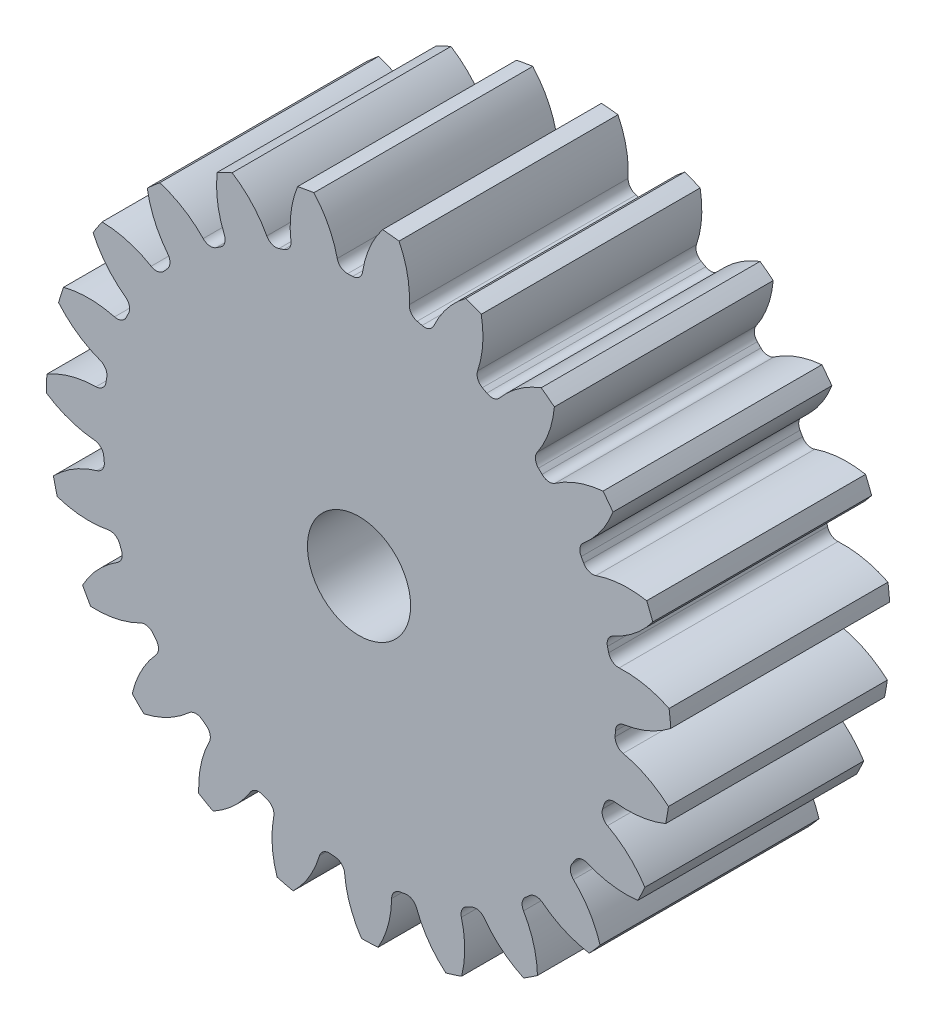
from build123d import *

# Parameters (mm, degrees)
SKETCH3_R         = 127
GEARBODY_DEPTH    = 88.9
TOOTHCUT_DEPTH    = 201.402619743
CIRPATTERN1_COUNT = 23
BOREDIA_R         = 20.955
BORE_DEPTH        = 12700


with BuildPart() as part:
    # Sketch3 → gearBody (new body)
    with BuildSketch(Plane.XY):
        Circle(SKETCH3_R)
    extrude(amount=GEARBODY_DEPTH)

    # Sketch2 → toothCut (cut, through all)
    with BuildSketch(Plane.XY):
        with BuildLine():
            ThreePointArc((104.040759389, -4.545325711), (104.08064853, -3.515423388), (104.11034289, -2.485176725))
            ThreePointArc((104.11034289, -2.485176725), (105.139821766, 0.147722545), (107.620292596, 1.50391198))
            ThreePointArc((107.620292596, 1.50391198), (117.866829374, 4.472601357), (127, 9.985298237))
            ThreePointArc((127, 9.985298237), (127.319336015, -4.30033227), (126.036805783, -18.531858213))
            ThreePointArc((126.036805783, -18.531858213), (117.296418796, -12.415464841), (107.27354631, -8.762156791))
            ThreePointArc((107.27354631, -8.762156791), (104.890237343, -7.241688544), (104.040759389, -4.545325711))
        make_face()
    toothcut = extrude(amount=TOOTHCUT_DEPTH, mode=Mode.SUBTRACT)

    # CirPattern1: toothCut ×23 about axis
    cirpattern1_axis = Axis((0, 0, 0), (0, 0, 1))
    for i in range(1, CIRPATTERN1_COUNT):
        add(toothcut.rotate(cirpattern1_axis, i * 360 / CIRPATTERN1_COUNT), mode=Mode.SUBTRACT)

    # boreDia → bore (cut, symmetric)
    with BuildSketch(Plane.XY):
        Circle(BOREDIA_R)
    extrude(amount=BORE_DEPTH, both=True, mode=Mode.SUBTRACT)


solid = part.part
